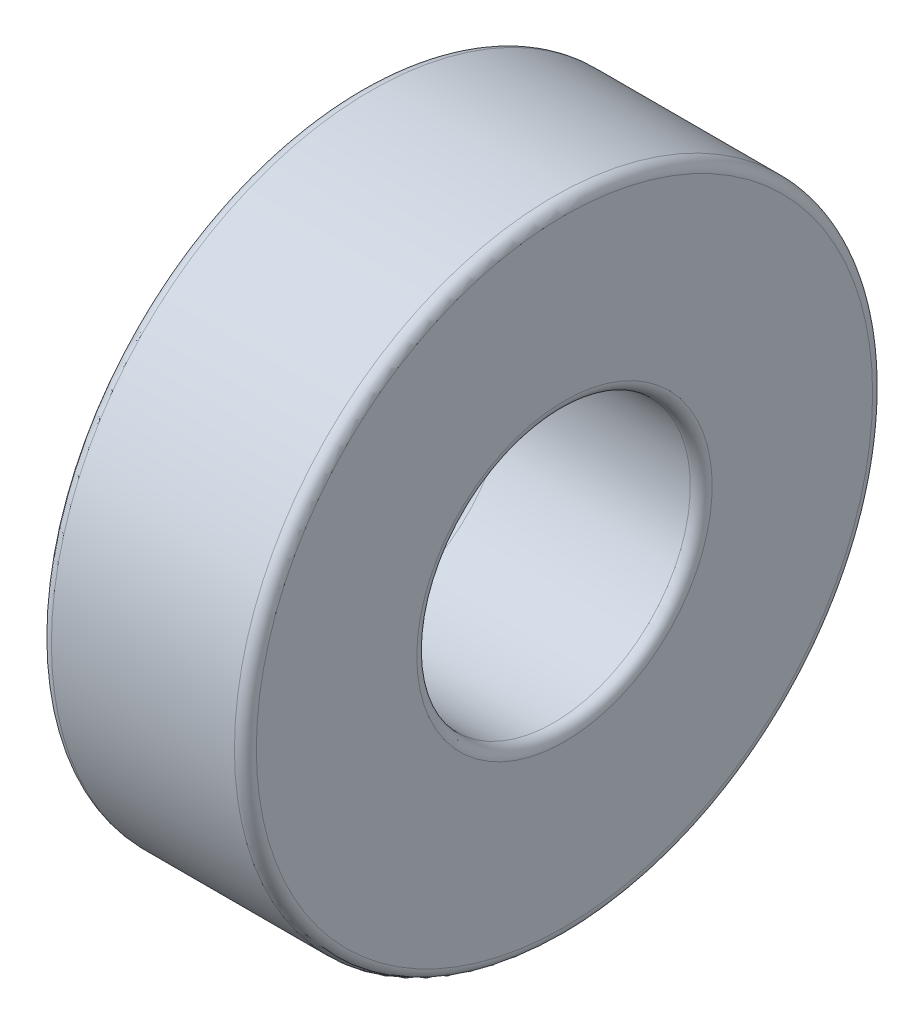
ISO-10303-21;
HEADER;
FILE_DESCRIPTION(('STEP AP214'),'2;1');
FILE_NAME('part.step','',(''),(''),'','','');
FILE_SCHEMA(('AUTOMOTIVE_DESIGN { 1 0 10303 214 1 1 1 1 }'));
ENDSEC;
DATA;
#1=APPLICATION_CONTEXT('core data for automotive mechanical design processes');
#2=APPLICATION_PROTOCOL_DEFINITION('international standard','automotive_design',2000,#1);
#3=PRODUCT_CONTEXT('',#1,'mechanical');
#4=PRODUCT('Part','Part','',(#3));
#5=PRODUCT_RELATED_PRODUCT_CATEGORY('part','',(#4));
#6=PRODUCT_DEFINITION_FORMATION('','',#4);
#7=PRODUCT_DEFINITION_CONTEXT('part definition',#1,'design');
#8=PRODUCT_DEFINITION('design','',#6,#7);
#9=PRODUCT_DEFINITION_SHAPE('','',#8);
#10=(LENGTH_UNIT() NAMED_UNIT(*) SI_UNIT(.MILLI.,.METRE.));
#11=(NAMED_UNIT(*) PLANE_ANGLE_UNIT() SI_UNIT($,.RADIAN.));
#12=(NAMED_UNIT(*) SI_UNIT($,.STERADIAN.) SOLID_ANGLE_UNIT());
#13=UNCERTAINTY_MEASURE_WITH_UNIT(LENGTH_MEASURE(1.E-05),#10,'distance_accuracy_value','');
#14=(GEOMETRIC_REPRESENTATION_CONTEXT(3) GLOBAL_UNCERTAINTY_ASSIGNED_CONTEXT((#13)) GLOBAL_UNIT_ASSIGNED_CONTEXT((#10,
#11,#12)) REPRESENTATION_CONTEXT('',''));
#15=CARTESIAN_POINT('',(0.,0.,0.));
#16=DIRECTION('',(0.,0.,1.));
#17=DIRECTION('',(1.,0.,0.));
#18=AXIS2_PLACEMENT_3D('',#15,#16,#17);
#19=CARTESIAN_POINT('',(0.,11.1125,0.));
#20=DIRECTION('',(1.,0.,0.));
#21=DIRECTION('',(0.,0.,-1.));
#22=AXIS2_PLACEMENT_3D('',#19,#20,#21);
#23=PLANE('',#22);
#24=CARTESIAN_POINT('',(0.,0.,0.));
#25=DIRECTION('',(1.,0.,0.));
#26=DIRECTION('',(0.,0.,-1.));
#27=AXIS2_PLACEMENT_3D('',#24,#25,#26);
#28=CIRCLE('',#27,5.1435);
#29=CARTESIAN_POINT('',(0.,0.,-5.1435));
#30=VERTEX_POINT('',#29);
#31=EDGE_CURVE('E10',#30,#30,#28,.T.);
#32=ORIENTED_EDGE('',*,*,#31,.T.);
#33=EDGE_LOOP('',(#32));
#34=FACE_BOUND('',#33,.T.);
#35=CARTESIAN_POINT('',(0.,0.,0.));
#36=DIRECTION('',(1.,0.,0.));
#37=DIRECTION('',(0.,0.,-1.));
#38=AXIS2_PLACEMENT_3D('',#35,#36,#37);
#39=CIRCLE('',#38,10.7315);
#40=CARTESIAN_POINT('',(0.,0.,-10.7315));
#41=VERTEX_POINT('',#40);
#42=EDGE_CURVE('E39',#41,#41,#39,.F.);
#43=ORIENTED_EDGE('',*,*,#42,.T.);
#44=EDGE_LOOP('',(#43));
#45=FACE_BOUND('',#44,.T.);
#46=ADVANCED_FACE('F32',(#34,#45),#23,.F.);
#47=CARTESIAN_POINT('',(0.,0.,0.));
#48=DIRECTION('',(-1.,0.,0.));
#49=DIRECTION('',(0.,0.,1.));
#50=AXIS2_PLACEMENT_3D('',#47,#48,#49);
#51=CYLINDRICAL_SURFACE('',#50,4.7625);
#52=CARTESIAN_POINT('',(6.7564,0.,0.));
#53=DIRECTION('',(-1.,0.,0.));
#54=DIRECTION('',(0.,0.,1.));
#55=AXIS2_PLACEMENT_3D('',#52,#53,#54);
#56=CIRCLE('',#55,4.7625);
#57=CARTESIAN_POINT('',(6.7564,0.,4.7625));
#58=VERTEX_POINT('',#57);
#59=EDGE_CURVE('E52',#58,#58,#56,.F.);
#60=ORIENTED_EDGE('',*,*,#59,.T.);
#61=EDGE_LOOP('',(#60));
#62=FACE_BOUND('',#61,.T.);
#63=CARTESIAN_POINT('',(0.381000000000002,0.,0.));
#64=DIRECTION('',(1.,0.,0.));
#65=DIRECTION('',(0.,0.,-1.));
#66=AXIS2_PLACEMENT_3D('',#63,#64,#65);
#67=CIRCLE('',#66,4.7625);
#68=CARTESIAN_POINT('',(0.381000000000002,0.,-4.7625));
#69=VERTEX_POINT('',#68);
#70=EDGE_CURVE('E55',#69,#69,#67,.F.);
#71=ORIENTED_EDGE('',*,*,#70,.T.);
#72=EDGE_LOOP('',(#71));
#73=FACE_BOUND('',#72,.T.);
#74=ADVANCED_FACE('F88',(#62,#73),#51,.F.);
#75=CARTESIAN_POINT('',(7.1374,4.7625,0.));
#76=DIRECTION('',(-1.,0.,0.));
#77=DIRECTION('',(0.,0.,1.));
#78=AXIS2_PLACEMENT_3D('',#75,#76,#77);
#79=PLANE('',#78);
#80=CARTESIAN_POINT('',(7.1374,0.,0.));
#81=DIRECTION('',(-1.,0.,0.));
#82=DIRECTION('',(0.,0.,1.));
#83=AXIS2_PLACEMENT_3D('',#80,#81,#82);
#84=CIRCLE('',#83,5.1435);
#85=CARTESIAN_POINT('',(7.1374,0.,5.1435));
#86=VERTEX_POINT('',#85);
#87=EDGE_CURVE('E58',#86,#86,#84,.T.);
#88=ORIENTED_EDGE('',*,*,#87,.T.);
#89=EDGE_LOOP('',(#88));
#90=FACE_BOUND('',#89,.T.);
#91=CARTESIAN_POINT('',(7.1374,0.,0.));
#92=DIRECTION('',(-1.,0.,0.));
#93=DIRECTION('',(0.,0.,1.));
#94=AXIS2_PLACEMENT_3D('',#91,#92,#93);
#95=CIRCLE('',#94,10.7315);
#96=CARTESIAN_POINT('',(7.1374,0.,10.7315));
#97=VERTEX_POINT('',#96);
#98=EDGE_CURVE('E61',#97,#97,#95,.F.);
#99=ORIENTED_EDGE('',*,*,#98,.T.);
#100=EDGE_LOOP('',(#99));
#101=FACE_BOUND('',#100,.T.);
#102=ADVANCED_FACE('F65',(#90,#101),#79,.F.);
#103=CARTESIAN_POINT('',(0.,0.,0.));
#104=DIRECTION('',(-1.,0.,0.));
#105=DIRECTION('',(0.,0.,1.));
#106=AXIS2_PLACEMENT_3D('',#103,#104,#105);
#107=CYLINDRICAL_SURFACE('',#106,11.1125);
#108=CARTESIAN_POINT('',(6.7564,0.,0.));
#109=DIRECTION('',(-1.,0.,0.));
#110=DIRECTION('',(0.,0.,1.));
#111=AXIS2_PLACEMENT_3D('',#108,#109,#110);
#112=CIRCLE('',#111,11.1125);
#113=CARTESIAN_POINT('',(6.7564,0.,11.1125));
#114=VERTEX_POINT('',#113);
#115=EDGE_CURVE('E43',#114,#114,#112,.T.);
#116=ORIENTED_EDGE('',*,*,#115,.T.);
#117=EDGE_LOOP('',(#116));
#118=FACE_BOUND('',#117,.T.);
#119=CARTESIAN_POINT('',(0.381000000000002,0.,0.));
#120=DIRECTION('',(1.,0.,0.));
#121=DIRECTION('',(0.,0.,-1.));
#122=AXIS2_PLACEMENT_3D('',#119,#120,#121);
#123=CIRCLE('',#122,11.1125);
#124=CARTESIAN_POINT('',(0.381000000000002,0.,-11.1125));
#125=VERTEX_POINT('',#124);
#126=EDGE_CURVE('E47',#125,#125,#123,.T.);
#127=ORIENTED_EDGE('',*,*,#126,.T.);
#128=EDGE_LOOP('',(#127));
#129=FACE_BOUND('',#128,.T.);
#130=ADVANCED_FACE('F75',(#118,#129),#107,.T.);
#131=CARTESIAN_POINT('',(6.7564,0.,0.));
#132=DIRECTION('',(-1.,0.,0.));
#133=DIRECTION('',(0.,0.,1.));
#134=AXIS2_PLACEMENT_3D('',#131,#132,#133);
#135=TOROIDAL_SURFACE('',#134,5.1435,0.381);
#136=ORIENTED_EDGE('',*,*,#59,.F.);
#137=EDGE_LOOP('',(#136));
#138=FACE_BOUND('',#137,.T.);
#139=ORIENTED_EDGE('',*,*,#87,.F.);
#140=EDGE_LOOP('',(#139));
#141=FACE_BOUND('',#140,.T.);
#142=ADVANCED_FACE('F71',(#138,#141),#135,.T.);
#143=CARTESIAN_POINT('',(6.7564,0.,0.));
#144=DIRECTION('',(-1.,0.,0.));
#145=DIRECTION('',(0.,0.,1.));
#146=AXIS2_PLACEMENT_3D('',#143,#144,#145);
#147=TOROIDAL_SURFACE('',#146,10.7315,0.381);
#148=ORIENTED_EDGE('',*,*,#98,.F.);
#149=EDGE_LOOP('',(#148));
#150=FACE_BOUND('',#149,.T.);
#151=ORIENTED_EDGE('',*,*,#115,.F.);
#152=EDGE_LOOP('',(#151));
#153=FACE_BOUND('',#152,.T.);
#154=ADVANCED_FACE('F67',(#150,#153),#147,.T.);
#155=CARTESIAN_POINT('',(0.381000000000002,0.,0.));
#156=DIRECTION('',(1.,0.,0.));
#157=DIRECTION('',(0.,0.,-1.));
#158=AXIS2_PLACEMENT_3D('',#155,#156,#157);
#159=TOROIDAL_SURFACE('',#158,5.1435,0.381);
#160=ORIENTED_EDGE('',*,*,#31,.F.);
#161=EDGE_LOOP('',(#160));
#162=FACE_BOUND('',#161,.T.);
#163=ORIENTED_EDGE('',*,*,#70,.F.);
#164=EDGE_LOOP('',(#163));
#165=FACE_BOUND('',#164,.T.);
#166=ADVANCED_FACE('F70',(#162,#165),#159,.T.);
#167=CARTESIAN_POINT('',(0.381000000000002,0.,0.));
#168=DIRECTION('',(1.,0.,0.));
#169=DIRECTION('',(0.,0.,-1.));
#170=AXIS2_PLACEMENT_3D('',#167,#168,#169);
#171=TOROIDAL_SURFACE('',#170,10.7315,0.381);
#172=ORIENTED_EDGE('',*,*,#126,.F.);
#173=EDGE_LOOP('',(#172));
#174=FACE_BOUND('',#173,.T.);
#175=ORIENTED_EDGE('',*,*,#42,.F.);
#176=EDGE_LOOP('',(#175));
#177=FACE_BOUND('',#176,.T.);
#178=ADVANCED_FACE('F34',(#174,#177),#171,.T.);
#179=CLOSED_SHELL('',(#46,#74,#102,#130,#142,#154,#166,#178));
#180=MANIFOLD_SOLID_BREP('B2',#179);
#181=ADVANCED_BREP_SHAPE_REPRESENTATION('',(#18,#180),#14);
#182=SHAPE_DEFINITION_REPRESENTATION(#9,#181);
ENDSEC;
END-ISO-10303-21;
